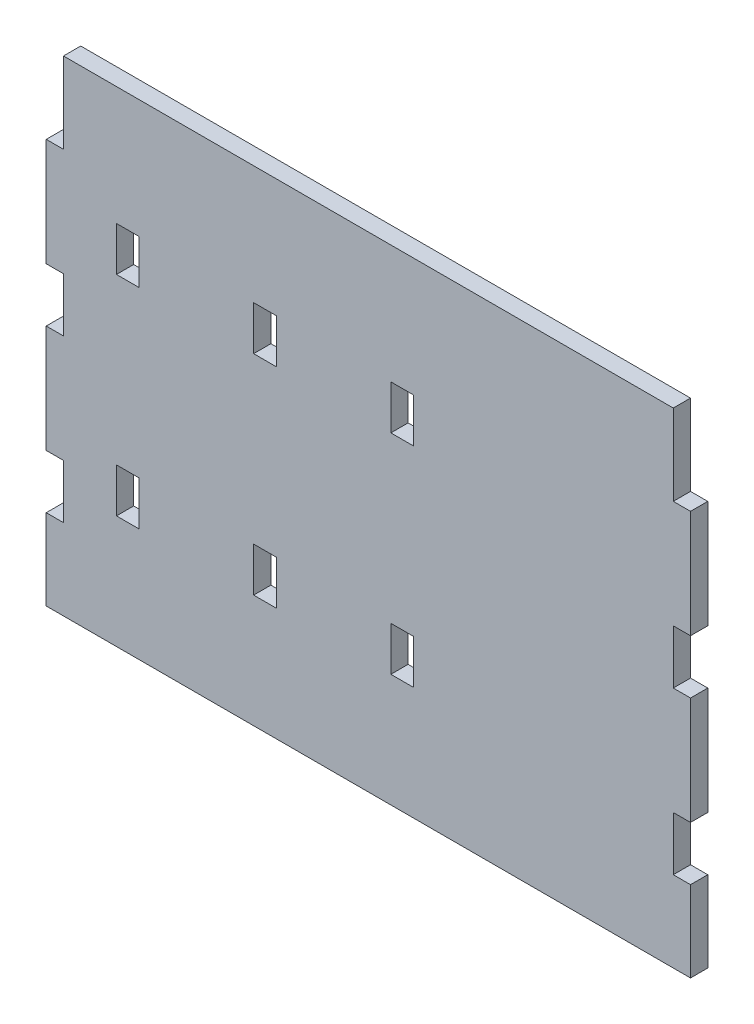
from build123d import *

# Parameters (mm, degrees)
SKETCH1_W           = 16
SKETCH1_H           = 100
SKETCH1_H_2         = 75
BOSS_EXTRUDE1_DEPTH = 16
SKETCH2_W           = 21
SKETCH2_H           = 41
CUT_EXTRUDE1_DEPTH  = 16


with BuildPart() as part:
    # Sketch1 → Boss-Extrude1 (new body)
    with BuildSketch(Plane.XY):
        with Locations((573.8, 425)):
            Rectangle(SKETCH1_W, SKETCH1_H)
        with Locations((573.8, 275)):
            Rectangle(SKETCH1_W, SKETCH1_H)
        with Locations((-8, 425)):
            Rectangle(SKETCH1_W, SKETCH1_H)
        with Locations((-8, 275)):
            Rectangle(SKETCH1_W, SKETCH1_H)
        with Locations((-8, 137.5)):
            Rectangle(SKETCH1_W, SKETCH1_H_2)
        Polygon((0, 175), (0, 100), (565.8, 100), (565.8, 175), (565.8, 225), (565.8, 325), (565.8, 375), (565.8, 475), (565.8, 550), (0, 550), (0, 475), (0, 375), (0, 325), (0, 225), align=None)
        with Locations((573.8, 137.5)):
            Rectangle(SKETCH1_W, SKETCH1_H_2)
    extrude(amount=BOSS_EXTRUDE1_DEPTH)

    # Sketch2 → Cut-Extrude1 (cut)
    with BuildSketch(Plane.XY.offset(16)):
        with Locations((59.65, 419.5)):
            Rectangle(SKETCH2_W, SKETCH2_H)
        with Locations((186.95, 419.5)):
            Rectangle(SKETCH2_W, SKETCH2_H)
        with Locations((314.25, 419.5)):
            Rectangle(SKETCH2_W, SKETCH2_H)
        with Locations((186.95, 225.5)):
            Rectangle(SKETCH2_W, SKETCH2_H)
        with Locations((314.25, 225.5)):
            Rectangle(SKETCH2_W, SKETCH2_H)
        with Locations((59.65, 225.5)):
            Rectangle(SKETCH2_W, SKETCH2_H)
    extrude(amount=-CUT_EXTRUDE1_DEPTH, mode=Mode.SUBTRACT)


solid = part.part
